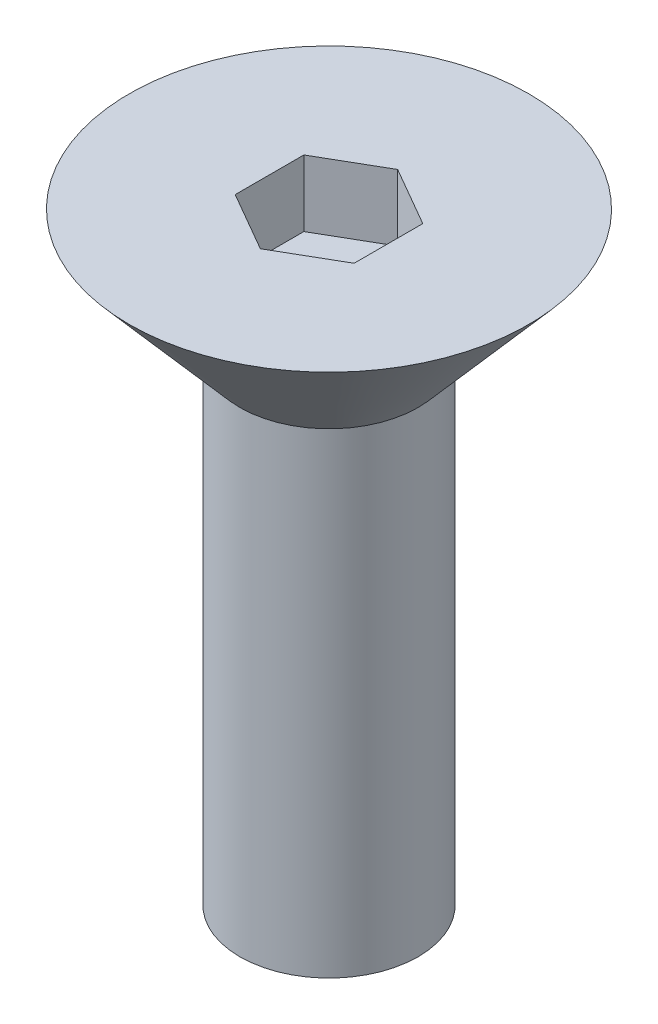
ISO-10303-21;
HEADER;
FILE_DESCRIPTION(('STEP AP214'),'2;1');
FILE_NAME('part.step','',(''),(''),'','','');
FILE_SCHEMA(('AUTOMOTIVE_DESIGN { 1 0 10303 214 1 1 1 1 }'));
ENDSEC;
DATA;
#1=APPLICATION_CONTEXT('core data for automotive mechanical design processes');
#2=APPLICATION_PROTOCOL_DEFINITION('international standard','automotive_design',2000,#1);
#3=PRODUCT_CONTEXT('',#1,'mechanical');
#4=PRODUCT('Part','Part','',(#3));
#5=PRODUCT_RELATED_PRODUCT_CATEGORY('part','',(#4));
#6=PRODUCT_DEFINITION_FORMATION('','',#4);
#7=PRODUCT_DEFINITION_CONTEXT('part definition',#1,'design');
#8=PRODUCT_DEFINITION('design','',#6,#7);
#9=PRODUCT_DEFINITION_SHAPE('','',#8);
#10=(LENGTH_UNIT() NAMED_UNIT(*) SI_UNIT(.MILLI.,.METRE.));
#11=(NAMED_UNIT(*) PLANE_ANGLE_UNIT() SI_UNIT($,.RADIAN.));
#12=(NAMED_UNIT(*) SI_UNIT($,.STERADIAN.) SOLID_ANGLE_UNIT());
#13=UNCERTAINTY_MEASURE_WITH_UNIT(LENGTH_MEASURE(1.E-05),#10,'distance_accuracy_value','');
#14=(GEOMETRIC_REPRESENTATION_CONTEXT(3) GLOBAL_UNCERTAINTY_ASSIGNED_CONTEXT((#13)) GLOBAL_UNIT_ASSIGNED_CONTEXT((#10,
#11,#12)) REPRESENTATION_CONTEXT('',''));
#15=CARTESIAN_POINT('',(0.,0.,0.));
#16=DIRECTION('',(0.,0.,1.));
#17=DIRECTION('',(1.,0.,0.));
#18=AXIS2_PLACEMENT_3D('',#15,#16,#17);
#19=CARTESIAN_POINT('',(1.50000000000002,-10.1396852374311,0.));
#20=DIRECTION('',(0.,-1.,0.));
#21=DIRECTION('',(0.,0.,-1.));
#22=AXIS2_PLACEMENT_3D('',#19,#20,#21);
#23=PLANE('',#22);
#24=CARTESIAN_POINT('',(0.,-10.1396852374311,0.));
#25=DIRECTION('',(0.,1.,0.));
#26=DIRECTION('',(0.,0.,1.));
#27=AXIS2_PLACEMENT_3D('',#24,#25,#26);
#28=CIRCLE('',#27,1.5);
#29=CARTESIAN_POINT('',(0.,-10.1396852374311,1.5));
#30=VERTEX_POINT('',#29);
#31=EDGE_CURVE('E11',#30,#30,#28,.T.);
#32=ORIENTED_EDGE('',*,*,#31,.F.);
#33=EDGE_LOOP('',(#32));
#34=FACE_BOUND('',#33,.T.);
#35=ADVANCED_FACE('F38',(#34),#23,.T.);
#36=CARTESIAN_POINT('',(0.,25.4,0.));
#37=DIRECTION('',(0.,1.,0.));
#38=DIRECTION('',(0.,0.,1.));
#39=AXIS2_PLACEMENT_3D('',#36,#37,#38);
#40=CYLINDRICAL_SURFACE('',#39,1.5);
#41=ORIENTED_EDGE('',*,*,#31,.T.);
#42=EDGE_LOOP('',(#41));
#43=FACE_BOUND('',#42,.T.);
#44=CARTESIAN_POINT('',(0.,-2.13968523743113,0.));
#45=DIRECTION('',(0.,1.,0.));
#46=DIRECTION('',(0.,0.,1.));
#47=AXIS2_PLACEMENT_3D('',#44,#45,#46);
#48=CIRCLE('',#47,1.5);
#49=CARTESIAN_POINT('',(0.,-2.13968523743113,1.50000000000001));
#50=VERTEX_POINT('',#49);
#51=EDGE_CURVE('E45',#50,#50,#48,.T.);
#52=ORIENTED_EDGE('',*,*,#51,.F.);
#53=EDGE_LOOP('',(#52));
#54=FACE_BOUND('',#53,.T.);
#55=ADVANCED_FACE('F152',(#43,#54),#40,.T.);
#56=CARTESIAN_POINT('',(0.,-2.13968523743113,0.));
#57=DIRECTION('',(0.,1.,0.));
#58=DIRECTION('',(0.,0.,1.));
#59=AXIS2_PLACEMENT_3D('',#56,#57,#58);
#60=CONICAL_SURFACE('',#59,1.5,0.715584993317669);
#61=CARTESIAN_POINT('',(0.,0.,0.));
#62=DIRECTION('',(0.,1.,0.));
#63=DIRECTION('',(0.,0.,1.));
#64=AXIS2_PLACEMENT_3D('',#61,#62,#63);
#65=CIRCLE('',#64,3.36);
#66=CARTESIAN_POINT('',(0.,0.,3.36000000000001));
#67=VERTEX_POINT('',#66);
#68=EDGE_CURVE('E140',#67,#67,#65,.T.);
#69=ORIENTED_EDGE('',*,*,#68,.F.);
#70=EDGE_LOOP('',(#69));
#71=FACE_BOUND('',#70,.T.);
#72=ORIENTED_EDGE('',*,*,#51,.T.);
#73=EDGE_LOOP('',(#72));
#74=FACE_BOUND('',#73,.T.);
#75=ADVANCED_FACE('F150',(#71,#74),#60,.T.);
#76=CARTESIAN_POINT('',(0.,0.,0.));
#77=DIRECTION('',(0.,1.,0.));
#78=DIRECTION('',(0.,0.,1.));
#79=AXIS2_PLACEMENT_3D('',#76,#77,#78);
#80=PLANE('',#79);
#81=DIRECTION('',(0.,0.,1.));
#82=VECTOR('',#81,1.);
#83=CARTESIAN_POINT('',(-0.999999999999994,0.,-0.577350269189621));
#84=LINE('',#83,#82);
#85=CARTESIAN_POINT('',(-0.999999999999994,0.,-0.577350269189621));
#86=VERTEX_POINT('',#85);
#87=CARTESIAN_POINT('',(-0.999999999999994,0.,0.577350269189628));
#88=VERTEX_POINT('',#87);
#89=EDGE_CURVE('E52',#86,#88,#84,.T.);
#90=ORIENTED_EDGE('',*,*,#89,.F.);
#91=DIRECTION('',(-0.866025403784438,0.,0.5));
#92=VECTOR('',#91,1.);
#93=CARTESIAN_POINT('',(0.,0.,-1.15470053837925));
#94=LINE('',#93,#92);
#95=CARTESIAN_POINT('',(0.,0.,-1.15470053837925));
#96=VERTEX_POINT('',#95);
#97=EDGE_CURVE('E136',#96,#86,#94,.T.);
#98=ORIENTED_EDGE('',*,*,#97,.F.);
#99=DIRECTION('',(0.866025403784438,0.,0.500000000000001));
#100=VECTOR('',#99,1.);
#101=CARTESIAN_POINT('',(0.,0.,-1.15470053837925));
#102=LINE('',#101,#100);
#103=CARTESIAN_POINT('',(0.999999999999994,0.,-0.577350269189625));
#104=VERTEX_POINT('',#103);
#105=EDGE_CURVE('E134',#96,#104,#102,.T.);
#106=ORIENTED_EDGE('',*,*,#105,.T.);
#107=DIRECTION('',(0.,0.,1.));
#108=VECTOR('',#107,1.);
#109=CARTESIAN_POINT('',(0.999999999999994,0.,-0.577350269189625));
#110=LINE('',#109,#108);
#111=CARTESIAN_POINT('',(1.,0.,0.577350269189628));
#112=VERTEX_POINT('',#111);
#113=EDGE_CURVE('E111',#104,#112,#110,.T.);
#114=ORIENTED_EDGE('',*,*,#113,.T.);
#115=DIRECTION('',(0.86602540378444,0.,-0.499999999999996));
#116=VECTOR('',#115,1.);
#117=CARTESIAN_POINT('',(0.,0.,1.15470053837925));
#118=LINE('',#117,#116);
#119=CARTESIAN_POINT('',(0.,0.,1.15470053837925));
#120=VERTEX_POINT('',#119);
#121=EDGE_CURVE('E130',#120,#112,#118,.T.);
#122=ORIENTED_EDGE('',*,*,#121,.F.);
#123=DIRECTION('',(-0.866025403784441,0.,-0.499999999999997));
#124=VECTOR('',#123,1.);
#125=CARTESIAN_POINT('',(0.,0.,1.15470053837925));
#126=LINE('',#125,#124);
#127=EDGE_CURVE('E127',#120,#88,#126,.T.);
#128=ORIENTED_EDGE('',*,*,#127,.T.);
#129=EDGE_LOOP('',(#90,#98,#106,#114,#122,#128));
#130=FACE_BOUND('',#129,.T.);
#131=ORIENTED_EDGE('',*,*,#68,.T.);
#132=EDGE_LOOP('',(#131));
#133=FACE_BOUND('',#132,.T.);
#134=ADVANCED_FACE('F159',(#130,#133),#80,.T.);
#135=CARTESIAN_POINT('',(-0.999999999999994,-1.116,-0.577350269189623));
#136=DIRECTION('',(-0.999999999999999,0.,0.));
#137=DIRECTION('',(0.,0.,1.));
#138=AXIS2_PLACEMENT_3D('',#135,#136,#137);
#139=PLANE('',#138);
#140=ORIENTED_EDGE('',*,*,#89,.T.);
#141=DIRECTION('',(0.,1.,0.));
#142=VECTOR('',#141,1.);
#143=CARTESIAN_POINT('',(-0.99999999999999,-1.11600000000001,0.577350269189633));
#144=LINE('',#143,#142);
#145=CARTESIAN_POINT('',(-0.99999999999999,-1.11600000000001,0.577350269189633));
#146=VERTEX_POINT('',#145);
#147=EDGE_CURVE('E125',#146,#88,#144,.T.);
#148=ORIENTED_EDGE('',*,*,#147,.F.);
#149=DIRECTION('',(0.,0.,1.));
#150=VECTOR('',#149,1.);
#151=CARTESIAN_POINT('',(-0.999999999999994,-1.116,-0.577350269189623));
#152=LINE('',#151,#150);
#153=CARTESIAN_POINT('',(-0.999999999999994,-1.116,-0.577350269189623));
#154=VERTEX_POINT('',#153);
#155=EDGE_CURVE('E138',#154,#146,#152,.T.);
#156=ORIENTED_EDGE('',*,*,#155,.F.);
#157=DIRECTION('',(0.,1.,0.));
#158=VECTOR('',#157,1.);
#159=CARTESIAN_POINT('',(-0.999999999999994,-1.116,-0.577350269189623));
#160=LINE('',#159,#158);
#161=EDGE_CURVE('E60',#154,#86,#160,.T.);
#162=ORIENTED_EDGE('',*,*,#161,.T.);
#163=EDGE_LOOP('',(#140,#148,#156,#162));
#164=FACE_BOUND('',#163,.T.);
#165=ADVANCED_FACE('F166',(#164),#139,.F.);
#166=CARTESIAN_POINT('',(0.,-1.116,-1.15470053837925));
#167=DIRECTION('',(-0.5,0.,-0.86602540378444));
#168=DIRECTION('',(-0.866025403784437,0.,0.5));
#169=AXIS2_PLACEMENT_3D('',#166,#167,#168);
#170=PLANE('',#169);
#171=ORIENTED_EDGE('',*,*,#97,.T.);
#172=ORIENTED_EDGE('',*,*,#161,.F.);
#173=DIRECTION('',(-0.866025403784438,0.,0.5));
#174=VECTOR('',#173,1.);
#175=CARTESIAN_POINT('',(0.,-1.116,-1.15470053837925));
#176=LINE('',#175,#174);
#177=CARTESIAN_POINT('',(0.,-1.116,-1.15470053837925));
#178=VERTEX_POINT('',#177);
#179=EDGE_CURVE('E104',#178,#154,#176,.T.);
#180=ORIENTED_EDGE('',*,*,#179,.F.);
#181=DIRECTION('',(0.,1.,0.));
#182=VECTOR('',#181,1.);
#183=CARTESIAN_POINT('',(0.,-1.116,-1.15470053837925));
#184=LINE('',#183,#182);
#185=EDGE_CURVE('E100',#178,#96,#184,.T.);
#186=ORIENTED_EDGE('',*,*,#185,.T.);
#187=EDGE_LOOP('',(#171,#172,#180,#186));
#188=FACE_BOUND('',#187,.T.);
#189=ADVANCED_FACE('F170',(#188),#170,.F.);
#190=CARTESIAN_POINT('',(0.,-1.116,-1.15470053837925));
#191=DIRECTION('',(-0.499999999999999,0.,0.86602540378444));
#192=DIRECTION('',(0.866025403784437,0.,0.500000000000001));
#193=AXIS2_PLACEMENT_3D('',#190,#191,#192);
#194=PLANE('',#193);
#195=ORIENTED_EDGE('',*,*,#105,.F.);
#196=ORIENTED_EDGE('',*,*,#185,.F.);
#197=DIRECTION('',(0.866025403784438,0.,0.500000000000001));
#198=VECTOR('',#197,1.);
#199=CARTESIAN_POINT('',(0.,-1.116,-1.15470053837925));
#200=LINE('',#199,#198);
#201=CARTESIAN_POINT('',(1.,-1.11600000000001,-0.57735026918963));
#202=VERTEX_POINT('',#201);
#203=EDGE_CURVE('E94',#178,#202,#200,.T.);
#204=ORIENTED_EDGE('',*,*,#203,.T.);
#205=DIRECTION('',(0.,1.,0.));
#206=VECTOR('',#205,1.);
#207=CARTESIAN_POINT('',(1.,-1.11600000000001,-0.57735026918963));
#208=LINE('',#207,#206);
#209=EDGE_CURVE('E98',#202,#104,#208,.T.);
#210=ORIENTED_EDGE('',*,*,#209,.T.);
#211=EDGE_LOOP('',(#195,#196,#204,#210));
#212=FACE_BOUND('',#211,.T.);
#213=ADVANCED_FACE('F97',(#212),#194,.T.);
#214=CARTESIAN_POINT('',(1.,-1.11600000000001,-0.57735026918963));
#215=DIRECTION('',(-0.999999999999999,0.,0.));
#216=DIRECTION('',(0.,0.,1.));
#217=AXIS2_PLACEMENT_3D('',#214,#215,#216);
#218=PLANE('',#217);
#219=ORIENTED_EDGE('',*,*,#113,.F.);
#220=ORIENTED_EDGE('',*,*,#209,.F.);
#221=DIRECTION('',(0.,0.,1.));
#222=VECTOR('',#221,1.);
#223=CARTESIAN_POINT('',(1.,-1.11600000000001,-0.57735026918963));
#224=LINE('',#223,#222);
#225=CARTESIAN_POINT('',(1.00000000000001,-1.11600000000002,0.577350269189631));
#226=VERTEX_POINT('',#225);
#227=EDGE_CURVE('E105',#202,#226,#224,.T.);
#228=ORIENTED_EDGE('',*,*,#227,.T.);
#229=DIRECTION('',(0.,1.,0.));
#230=VECTOR('',#229,1.);
#231=CARTESIAN_POINT('',(1.00000000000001,-1.11600000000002,0.577350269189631));
#232=LINE('',#231,#230);
#233=EDGE_CURVE('E113',#226,#112,#232,.T.);
#234=ORIENTED_EDGE('',*,*,#233,.T.);
#235=EDGE_LOOP('',(#219,#220,#228,#234));
#236=FACE_BOUND('',#235,.T.);
#237=ADVANCED_FACE('F108',(#236),#218,.T.);
#238=CARTESIAN_POINT('',(0.,-1.11600000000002,1.15470053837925));
#239=DIRECTION('',(0.499999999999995,0.,0.866025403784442));
#240=DIRECTION('',(0.86602540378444,0.,-0.499999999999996));
#241=AXIS2_PLACEMENT_3D('',#238,#239,#240);
#242=PLANE('',#241);
#243=ORIENTED_EDGE('',*,*,#121,.T.);
#244=ORIENTED_EDGE('',*,*,#233,.F.);
#245=DIRECTION('',(0.86602540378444,0.,-0.499999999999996));
#246=VECTOR('',#245,1.);
#247=CARTESIAN_POINT('',(0.,-1.11600000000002,1.15470053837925));
#248=LINE('',#247,#246);
#249=CARTESIAN_POINT('',(0.,-1.11600000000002,1.15470053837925));
#250=VERTEX_POINT('',#249);
#251=EDGE_CURVE('E119',#250,#226,#248,.T.);
#252=ORIENTED_EDGE('',*,*,#251,.F.);
#253=DIRECTION('',(0.,1.,0.));
#254=VECTOR('',#253,1.);
#255=CARTESIAN_POINT('',(0.,-1.11600000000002,1.15470053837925));
#256=LINE('',#255,#254);
#257=EDGE_CURVE('E143',#250,#120,#256,.T.);
#258=ORIENTED_EDGE('',*,*,#257,.T.);
#259=EDGE_LOOP('',(#243,#244,#252,#258));
#260=FACE_BOUND('',#259,.T.);
#261=ADVANCED_FACE('F174',(#260),#242,.F.);
#262=CARTESIAN_POINT('',(0.,-1.11600000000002,1.15470053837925));
#263=DIRECTION('',(0.499999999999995,0.,-0.866025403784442));
#264=DIRECTION('',(-0.866025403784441,0.,-0.499999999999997));
#265=AXIS2_PLACEMENT_3D('',#262,#263,#264);
#266=PLANE('',#265);
#267=ORIENTED_EDGE('',*,*,#127,.F.);
#268=ORIENTED_EDGE('',*,*,#257,.F.);
#269=DIRECTION('',(-0.866025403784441,0.,-0.499999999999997));
#270=VECTOR('',#269,1.);
#271=CARTESIAN_POINT('',(0.,-1.11600000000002,1.15470053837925));
#272=LINE('',#271,#270);
#273=EDGE_CURVE('E86',#250,#146,#272,.T.);
#274=ORIENTED_EDGE('',*,*,#273,.T.);
#275=ORIENTED_EDGE('',*,*,#147,.T.);
#276=EDGE_LOOP('',(#267,#268,#274,#275));
#277=FACE_BOUND('',#276,.T.);
#278=ADVANCED_FACE('F171',(#277),#266,.T.);
#279=CARTESIAN_POINT('',(-0.999999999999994,-1.11600000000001,1.73205080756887));
#280=DIRECTION('',(0.,1.,0.));
#281=DIRECTION('',(0.,0.,1.));
#282=AXIS2_PLACEMENT_3D('',#279,#280,#281);
#283=PLANE('',#282);
#284=ORIENTED_EDGE('',*,*,#155,.T.);
#285=ORIENTED_EDGE('',*,*,#273,.F.);
#286=ORIENTED_EDGE('',*,*,#251,.T.);
#287=ORIENTED_EDGE('',*,*,#227,.F.);
#288=ORIENTED_EDGE('',*,*,#203,.F.);
#289=ORIENTED_EDGE('',*,*,#179,.T.);
#290=EDGE_LOOP('',(#284,#285,#286,#287,#288,#289));
#291=FACE_BOUND('',#290,.T.);
#292=ADVANCED_FACE('F117',(#291),#283,.T.);
#293=CLOSED_SHELL('',(#35,#55,#75,#134,#165,#189,#213,#237,#261,#278,#292));
#294=MANIFOLD_SOLID_BREP('B2',#293);
#295=ADVANCED_BREP_SHAPE_REPRESENTATION('',(#18,#294),#14);
#296=SHAPE_DEFINITION_REPRESENTATION(#9,#295);
ENDSEC;
END-ISO-10303-21;
